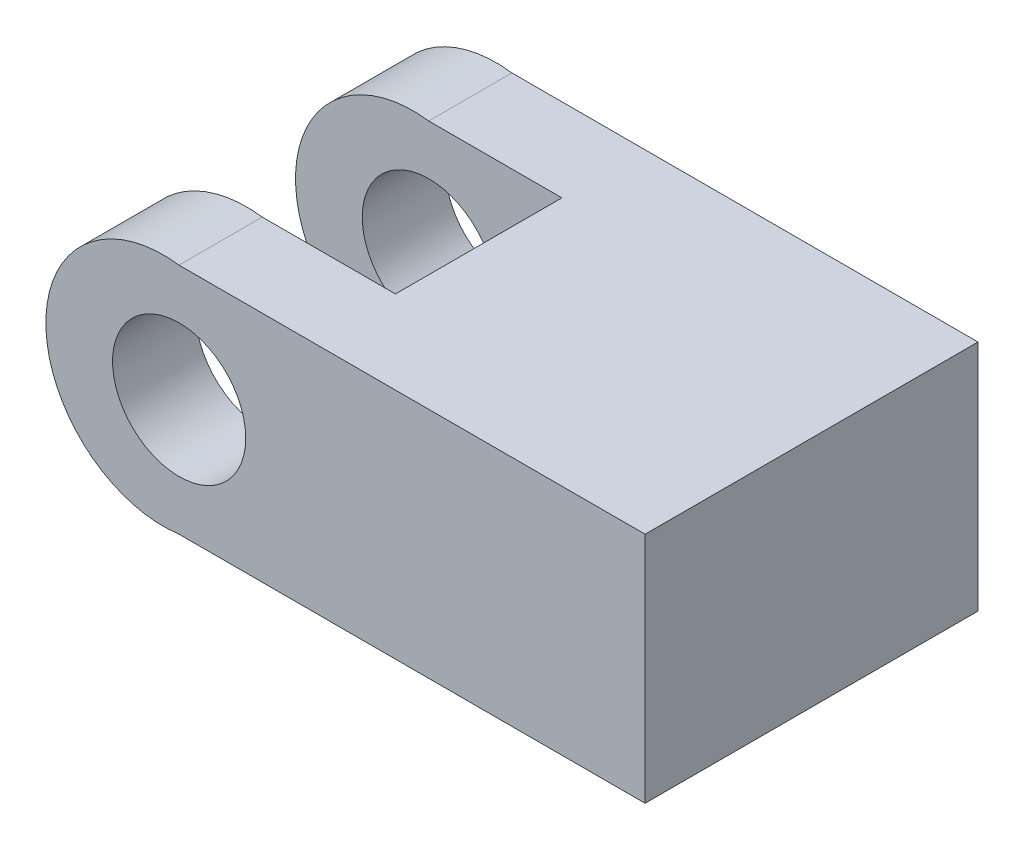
from build123d import *

# Parameters (mm, degrees)
ESQUISSE1_W                  = 10
ESQUISSE1_H                  = 10
BOSS_EXTRU_1_DEPTH           = 7
BOSS_EXTRU_2_DEPTH           = 10
ESQUISSE6_R                  = 2
ENL_V_MAT_EXTRU_1_DEPTH      = 16.793621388
ENL_V_MAT_EXTRU_3_DEPTH      = 10
ENL_V_MAT_EXTRU_3_DEPTH_BACK = 10
ESQUISSE7_W                  = 8.534065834
ESQUISSE7_H                  = 5


with BuildPart() as part:
    # Esquisse1 → Boss.-Extru.1 (new body)
    with BuildSketch(Plane(origin=(0, 0, 0), x_dir=(1, 0, 0), z_dir=(0, 1, 0))):
        with Locations((5, 5)):
            Rectangle(ESQUISSE1_W, ESQUISSE1_H)
    extrude(amount=BOSS_EXTRU_1_DEPTH)

    # Esquisse2 → Boss.-Extru.2 (add)
    with BuildSketch(Plane.XY):
        with BuildLine():
            Line((0, 7), (0, 0))
            Line((0, 0), (-4, 0))
            ThreePointArc((-4, 0), (-8, 3.5), (-4, 7))
            Line((-4, 7), (0, 7))
        make_face()
    extrude(amount=-BOSS_EXTRU_2_DEPTH)

    # Esquisse6 → Enl_v. mat.-Extru.1 (cut, through all)
    with BuildSketch(Plane.XY):
        with Locations((-3.99631755, 3.5)):
            Circle(ESQUISSE6_R)
    extrude(amount=-ENL_V_MAT_EXTRU_1_DEPTH, mode=Mode.SUBTRACT)

    # Esquisse7 → Enl_v. mat.-Extru.3 (cut, two sides: drawn at the far end of the back side and taken through both)
    with BuildSketch(Plane(origin=(0, 7, 0), x_dir=(1, 0, 0), z_dir=(0, 1, 0)).offset(-ENL_V_MAT_EXTRU_3_DEPTH_BACK)):
        with Locations((-4.267032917, 5)):
            Rectangle(ESQUISSE7_W, ESQUISSE7_H)
    extrude(amount=ENL_V_MAT_EXTRU_3_DEPTH + ENL_V_MAT_EXTRU_3_DEPTH_BACK, mode=Mode.SUBTRACT)


solid = part.part
